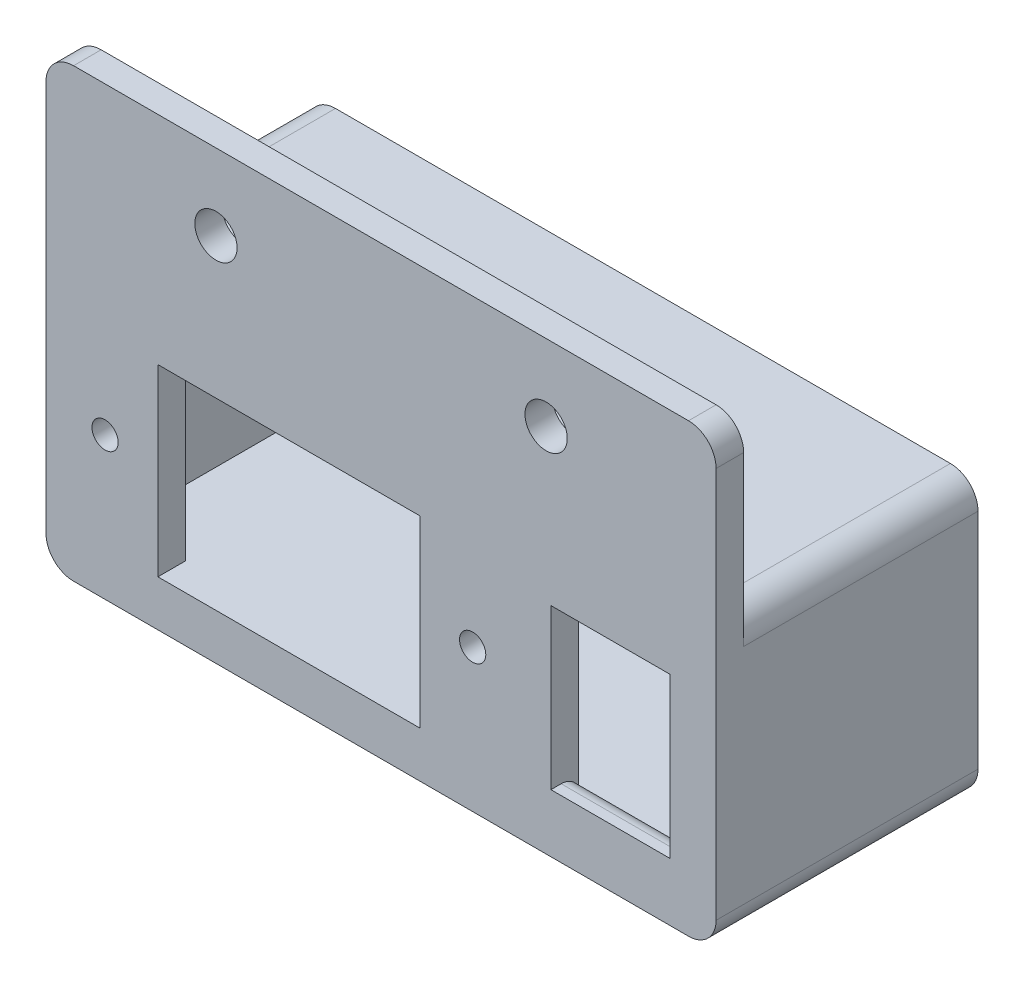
ISO-10303-21;
HEADER;
FILE_DESCRIPTION(('STEP AP214'),'2;1');
FILE_NAME('part.step','',(''),(''),'','','');
FILE_SCHEMA(('AUTOMOTIVE_DESIGN { 1 0 10303 214 1 1 1 1 }'));
ENDSEC;
DATA;
#1=APPLICATION_CONTEXT('core data for automotive mechanical design processes');
#2=APPLICATION_PROTOCOL_DEFINITION('international standard','automotive_design',2000,#1);
#3=PRODUCT_CONTEXT('',#1,'mechanical');
#4=PRODUCT('Part','Part','',(#3));
#5=PRODUCT_RELATED_PRODUCT_CATEGORY('part','',(#4));
#6=PRODUCT_DEFINITION_FORMATION('','',#4);
#7=PRODUCT_DEFINITION_CONTEXT('part definition',#1,'design');
#8=PRODUCT_DEFINITION('design','',#6,#7);
#9=PRODUCT_DEFINITION_SHAPE('','',#8);
#10=(LENGTH_UNIT() NAMED_UNIT(*) SI_UNIT(.MILLI.,.METRE.));
#11=(NAMED_UNIT(*) PLANE_ANGLE_UNIT() SI_UNIT($,.RADIAN.));
#12=(NAMED_UNIT(*) SI_UNIT($,.STERADIAN.) SOLID_ANGLE_UNIT());
#13=UNCERTAINTY_MEASURE_WITH_UNIT(LENGTH_MEASURE(1.E-05),#10,'distance_accuracy_value','');
#14=(GEOMETRIC_REPRESENTATION_CONTEXT(3) GLOBAL_UNCERTAINTY_ASSIGNED_CONTEXT((#13)) GLOBAL_UNIT_ASSIGNED_CONTEXT((#10,
#11,#12)) REPRESENTATION_CONTEXT('',''));
#15=CARTESIAN_POINT('',(0.,0.,0.));
#16=DIRECTION('',(0.,0.,1.));
#17=DIRECTION('',(1.,0.,0.));
#18=AXIS2_PLACEMENT_3D('',#15,#16,#17);
#19=CARTESIAN_POINT('',(33.985001,10.3,-21.));
#20=DIRECTION('',(0.,-1.,0.));
#21=DIRECTION('',(0.,0.,-1.));
#22=AXIS2_PLACEMENT_3D('',#19,#20,#21);
#23=PLANE('',#22);
#24=DIRECTION('',(0.,0.,1.));
#25=VECTOR('',#24,1.);
#26=CARTESIAN_POINT('',(31.985001,10.3,-21.));
#27=LINE('',#26,#25);
#28=CARTESIAN_POINT('',(31.985001,10.3,-24.));
#29=VERTEX_POINT('',#28);
#30=CARTESIAN_POINT('',(31.985001,10.3,0.));
#31=VERTEX_POINT('',#30);
#32=EDGE_CURVE('E286',#29,#31,#27,.T.);
#33=ORIENTED_EDGE('',*,*,#32,.T.);
#34=DIRECTION('',(1.,0.,0.));
#35=VECTOR('',#34,1.);
#36=CARTESIAN_POINT('',(33.985001,10.3,0.));
#37=LINE('',#36,#35);
#38=CARTESIAN_POINT('',(19.014999,10.3,0.));
#39=VERTEX_POINT('',#38);
#40=EDGE_CURVE('E291',#39,#31,#37,.T.);
#41=ORIENTED_EDGE('',*,*,#40,.F.);
#42=CARTESIAN_POINT('',(-30.9265875,10.3,0.));
#43=VERTEX_POINT('',#42);
#44=EDGE_CURVE('E292',#43,#39,#37,.T.);
#45=ORIENTED_EDGE('',*,*,#44,.F.);
#46=DIRECTION('',(0.,0.,1.));
#47=VECTOR('',#46,1.);
#48=CARTESIAN_POINT('',(-30.9265875,10.3,-21.));
#49=LINE('',#48,#47);
#50=CARTESIAN_POINT('',(-30.9265875,10.3,-24.));
#51=VERTEX_POINT('',#50);
#52=EDGE_CURVE('E283',#51,#43,#49,.T.);
#53=ORIENTED_EDGE('',*,*,#52,.F.);
#54=DIRECTION('',(1.,0.,0.));
#55=VECTOR('',#54,1.);
#56=CARTESIAN_POINT('',(-30.9265875,10.3,-24.));
#57=LINE('',#56,#55);
#58=EDGE_CURVE('E255',#51,#29,#57,.T.);
#59=ORIENTED_EDGE('',*,*,#58,.T.);
#60=EDGE_LOOP('',(#33,#41,#45,#53,#59));
#61=FACE_BOUND('',#60,.T.);
#62=ADVANCED_FACE('F35',(#61),#23,.T.);
#63=CARTESIAN_POINT('',(0.529206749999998,-58.9988552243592,0.));
#64=DIRECTION('',(0.,0.,1.));
#65=DIRECTION('',(1.,0.,0.));
#66=AXIS2_PLACEMENT_3D('',#63,#64,#65);
#67=PLANE('',#66);
#68=CARTESIAN_POINT('',(-17.434087,25.3,0.));
#69=DIRECTION('',(0.,0.,-1.));
#70=DIRECTION('',(1.,0.,0.));
#71=AXIS2_PLACEMENT_3D('',#68,#69,#70);
#72=CIRCLE('',#71,2.3);
#73=CARTESIAN_POINT('',(-15.134087,25.3,0.));
#74=VERTEX_POINT('',#73);
#75=EDGE_CURVE('E811',#74,#74,#72,.T.);
#76=ORIENTED_EDGE('',*,*,#75,.F.);
#77=EDGE_LOOP('',(#76));
#78=FACE_BOUND('',#77,.T.);
#79=CARTESIAN_POINT('',(18.4925005,25.3,0.));
#80=DIRECTION('',(0.,0.,-1.));
#81=DIRECTION('',(-1.,0.,0.));
#82=AXIS2_PLACEMENT_3D('',#79,#80,#81);
#83=CIRCLE('',#82,2.3);
#84=CARTESIAN_POINT('',(16.1925005,25.3,0.));
#85=VERTEX_POINT('',#84);
#86=EDGE_CURVE('E235',#85,#85,#83,.T.);
#87=ORIENTED_EDGE('',*,*,#86,.F.);
#88=EDGE_LOOP('',(#87));
#89=FACE_BOUND('',#88,.T.);
#90=DIRECTION('',(1.,0.,0.));
#91=VECTOR('',#90,1.);
#92=CARTESIAN_POINT('',(0.529206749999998,33.5776,0.));
#93=LINE('',#92,#91);
#94=CARTESIAN_POINT('',(-32.9265875,33.5776,0.));
#95=VERTEX_POINT('',#94);
#96=CARTESIAN_POINT('',(33.985001,33.5776,0.));
#97=VERTEX_POINT('',#96);
#98=EDGE_CURVE('E345',#95,#97,#93,.T.);
#99=ORIENTED_EDGE('',*,*,#98,.T.);
#100=CARTESIAN_POINT('',(33.985001,30.5776,0.));
#101=DIRECTION('',(0.,0.,1.));
#102=DIRECTION('',(1.,0.,0.));
#103=AXIS2_PLACEMENT_3D('',#100,#101,#102);
#104=CIRCLE('',#103,3.);
#105=CARTESIAN_POINT('',(36.985001,30.5776,0.));
#106=VERTEX_POINT('',#105);
#107=EDGE_CURVE('E375',#97,#106,#104,.F.);
#108=ORIENTED_EDGE('',*,*,#107,.T.);
#109=DIRECTION('',(0.,-1.,0.));
#110=VECTOR('',#109,1.);
#111=CARTESIAN_POINT('',(36.985001,-58.9988552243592,0.));
#112=LINE('',#111,#110);
#113=CARTESIAN_POINT('',(36.985001,12.3,0.));
#114=VERTEX_POINT('',#113);
#115=EDGE_CURVE('E342',#106,#114,#112,.T.);
#116=ORIENTED_EDGE('',*,*,#115,.T.);
#117=CARTESIAN_POINT('',(33.985001,12.3,0.));
#118=DIRECTION('',(0.,0.,1.));
#119=DIRECTION('',(1.,0.,0.));
#120=AXIS2_PLACEMENT_3D('',#117,#118,#119);
#121=CIRCLE('',#120,3.);
#122=CARTESIAN_POINT('',(33.985001,15.3,0.));
#123=VERTEX_POINT('',#122);
#124=EDGE_CURVE('E380',#114,#123,#121,.T.);
#125=ORIENTED_EDGE('',*,*,#124,.T.);
#126=DIRECTION('',(-1.,0.,0.));
#127=VECTOR('',#126,1.);
#128=CARTESIAN_POINT('',(-67.7584484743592,15.3,0.));
#129=LINE('',#128,#127);
#130=CARTESIAN_POINT('',(-32.9265875,15.3,0.));
#131=VERTEX_POINT('',#130);
#132=EDGE_CURVE('E268',#123,#131,#129,.T.);
#133=ORIENTED_EDGE('',*,*,#132,.T.);
#134=CARTESIAN_POINT('',(-32.9265875,12.3,0.));
#135=DIRECTION('',(0.,0.,1.));
#136=DIRECTION('',(1.,0.,0.));
#137=AXIS2_PLACEMENT_3D('',#134,#135,#136);
#138=CIRCLE('',#137,3.);
#139=CARTESIAN_POINT('',(-35.9265875,12.3,0.));
#140=VERTEX_POINT('',#139);
#141=EDGE_CURVE('E377',#131,#140,#138,.T.);
#142=ORIENTED_EDGE('',*,*,#141,.T.);
#143=DIRECTION('',(0.,1.,0.));
#144=VECTOR('',#143,1.);
#145=CARTESIAN_POINT('',(-35.9265875,-58.9988552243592,0.));
#146=LINE('',#145,#144);
#147=CARTESIAN_POINT('',(-35.9265875,30.5776,0.));
#148=VERTEX_POINT('',#147);
#149=EDGE_CURVE('E442',#140,#148,#146,.T.);
#150=ORIENTED_EDGE('',*,*,#149,.T.);
#151=CARTESIAN_POINT('',(-32.9265875,30.5776,0.));
#152=DIRECTION('',(0.,0.,1.));
#153=DIRECTION('',(1.,0.,0.));
#154=AXIS2_PLACEMENT_3D('',#151,#152,#153);
#155=CIRCLE('',#154,3.);
#156=EDGE_CURVE('E373',#148,#95,#155,.F.);
#157=ORIENTED_EDGE('',*,*,#156,.T.);
#158=EDGE_LOOP('',(#99,#108,#116,#125,#133,#142,#150,#157));
#159=FACE_BOUND('',#158,.T.);
#160=ADVANCED_FACE('F489',(#78,#89,#159),#67,.F.);
#161=CARTESIAN_POINT('',(0.529206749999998,8.67556,3.));
#162=DIRECTION('',(0.,1.,0.));
#163=DIRECTION('',(0.,0.,1.));
#164=AXIS2_PLACEMENT_3D('',#161,#162,#163);
#165=PLANE('',#164);
#166=DIRECTION('',(0.,0.,-1.));
#167=VECTOR('',#166,1.);
#168=CARTESIAN_POINT('',(19.014999,8.67556,3.));
#169=LINE('',#168,#167);
#170=CARTESIAN_POINT('',(19.014999,8.67556,3.));
#171=VERTEX_POINT('',#170);
#172=CARTESIAN_POINT('',(19.014999,8.67556,1.96442222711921));
#173=VERTEX_POINT('',#172);
#174=EDGE_CURVE('E395',#171,#173,#169,.T.);
#175=ORIENTED_EDGE('',*,*,#174,.T.);
#176=DIRECTION('',(1.,0.,0.));
#177=VECTOR('',#176,1.);
#178=CARTESIAN_POINT('',(0.529206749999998,8.67556,1.96442222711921));
#179=LINE('',#178,#177);
#180=CARTESIAN_POINT('',(31.985001,8.67556,1.96442222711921));
#181=VERTEX_POINT('',#180);
#182=EDGE_CURVE('E382',#173,#181,#179,.T.);
#183=ORIENTED_EDGE('',*,*,#182,.T.);
#184=DIRECTION('',(0.,0.,-1.));
#185=VECTOR('',#184,1.);
#186=CARTESIAN_POINT('',(31.985001,8.67556,3.));
#187=LINE('',#186,#185);
#188=CARTESIAN_POINT('',(31.985001,8.67556,3.));
#189=VERTEX_POINT('',#188);
#190=EDGE_CURVE('E412',#189,#181,#187,.T.);
#191=ORIENTED_EDGE('',*,*,#190,.F.);
#192=DIRECTION('',(1.,0.,0.));
#193=VECTOR('',#192,1.);
#194=CARTESIAN_POINT('',(0.529206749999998,8.67556,3.));
#195=LINE('',#194,#193);
#196=EDGE_CURVE('E325',#171,#189,#195,.T.);
#197=ORIENTED_EDGE('',*,*,#196,.F.);
#198=EDGE_LOOP('',(#175,#183,#191,#197));
#199=FACE_BOUND('',#198,.T.);
#200=ADVANCED_FACE('F402',(#199),#165,.F.);
#201=CARTESIAN_POINT('',(31.985001,-58.9988552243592,3.));
#202=DIRECTION('',(1.,0.,0.));
#203=DIRECTION('',(0.,1.,0.));
#204=AXIS2_PLACEMENT_3D('',#201,#202,#203);
#205=PLANE('',#204);
#206=ORIENTED_EDGE('',*,*,#190,.T.);
#207=CARTESIAN_POINT('',(31.985001,10.67556,1.96442222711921));
#208=DIRECTION('',(1.,0.,0.));
#209=DIRECTION('',(0.,1.,0.));
#210=AXIS2_PLACEMENT_3D('',#207,#208,#209);
#211=CIRCLE('',#210,2.);
#212=EDGE_CURVE('E387',#181,#31,#211,.T.);
#213=ORIENTED_EDGE('',*,*,#212,.T.);
#214=ORIENTED_EDGE('',*,*,#32,.F.);
#215=DIRECTION('',(0.,-1.,0.));
#216=VECTOR('',#215,1.);
#217=CARTESIAN_POINT('',(31.985001,10.3,-24.));
#218=LINE('',#217,#216);
#219=CARTESIAN_POINT('',(31.985001,-10.,-24.));
#220=VERTEX_POINT('',#219);
#221=EDGE_CURVE('E258',#29,#220,#218,.T.);
#222=ORIENTED_EDGE('',*,*,#221,.T.);
#223=DIRECTION('',(0.,0.,1.));
#224=VECTOR('',#223,1.);
#225=CARTESIAN_POINT('',(31.985001,-10.,-21.));
#226=LINE('',#225,#224);
#227=CARTESIAN_POINT('',(31.985001,-9.99999999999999,0.));
#228=VERTEX_POINT('',#227);
#229=EDGE_CURVE('E289',#220,#228,#226,.T.);
#230=ORIENTED_EDGE('',*,*,#229,.T.);
#231=CARTESIAN_POINT('',(31.985001,-10.67556,1.88245018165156));
#232=DIRECTION('',(1.,0.,0.));
#233=DIRECTION('',(0.,1.,0.));
#234=AXIS2_PLACEMENT_3D('',#231,#232,#233);
#235=CIRCLE('',#234,2.);
#236=CARTESIAN_POINT('',(31.985001,-8.67556,1.88245018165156));
#237=VERTEX_POINT('',#236);
#238=EDGE_CURVE('E43',#228,#237,#235,.T.);
#239=ORIENTED_EDGE('',*,*,#238,.T.);
#240=DIRECTION('',(0.,0.,-1.));
#241=VECTOR('',#240,1.);
#242=CARTESIAN_POINT('',(31.985001,-8.67556,3.));
#243=LINE('',#242,#241);
#244=CARTESIAN_POINT('',(31.985001,-8.67556,3.));
#245=VERTEX_POINT('',#244);
#246=EDGE_CURVE('E428',#245,#237,#243,.T.);
#247=ORIENTED_EDGE('',*,*,#246,.F.);
#248=DIRECTION('',(0.,-1.,0.));
#249=VECTOR('',#248,1.);
#250=CARTESIAN_POINT('',(31.985001,-58.9988552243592,3.));
#251=LINE('',#250,#249);
#252=EDGE_CURVE('E328',#189,#245,#251,.T.);
#253=ORIENTED_EDGE('',*,*,#252,.F.);
#254=EDGE_LOOP('',(#206,#213,#214,#222,#230,#239,#247,#253));
#255=FACE_BOUND('',#254,.T.);
#256=ADVANCED_FACE('F411',(#255),#205,.F.);
#257=CARTESIAN_POINT('',(0.529206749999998,-8.67556,3.));
#258=DIRECTION('',(0.,1.,0.));
#259=DIRECTION('',(0.,0.,1.));
#260=AXIS2_PLACEMENT_3D('',#257,#258,#259);
#261=PLANE('',#260);
#262=ORIENTED_EDGE('',*,*,#246,.T.);
#263=DIRECTION('',(1.,0.,0.));
#264=VECTOR('',#263,1.);
#265=CARTESIAN_POINT('',(19.014999,-8.67556,1.88245018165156));
#266=LINE('',#265,#264);
#267=CARTESIAN_POINT('',(19.014999,-8.67556,1.88245018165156));
#268=VERTEX_POINT('',#267);
#269=EDGE_CURVE('E56',#237,#268,#266,.F.);
#270=ORIENTED_EDGE('',*,*,#269,.T.);
#271=DIRECTION('',(0.,0.,-1.));
#272=VECTOR('',#271,1.);
#273=CARTESIAN_POINT('',(19.014999,-8.67556,3.));
#274=LINE('',#273,#272);
#275=CARTESIAN_POINT('',(19.014999,-8.67556,3.));
#276=VERTEX_POINT('',#275);
#277=EDGE_CURVE('E406',#276,#268,#274,.T.);
#278=ORIENTED_EDGE('',*,*,#277,.F.);
#279=DIRECTION('',(1.,0.,0.));
#280=VECTOR('',#279,1.);
#281=CARTESIAN_POINT('',(0.529206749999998,-8.67556,3.));
#282=LINE('',#281,#280);
#283=EDGE_CURVE('E330',#276,#245,#282,.T.);
#284=ORIENTED_EDGE('',*,*,#283,.T.);
#285=EDGE_LOOP('',(#262,#270,#278,#284));
#286=FACE_BOUND('',#285,.T.);
#287=ADVANCED_FACE('F479',(#286),#261,.T.);
#288=CARTESIAN_POINT('',(0.529206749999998,9.99999999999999,3.));
#289=DIRECTION('',(0.,1.,0.));
#290=DIRECTION('',(0.,0.,1.));
#291=AXIS2_PLACEMENT_3D('',#288,#289,#290);
#292=PLANE('',#291);
#293=DIRECTION('',(1.,0.,0.));
#294=VECTOR('',#293,1.);
#295=CARTESIAN_POINT('',(0.529206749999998,9.99999999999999,0.));
#296=LINE('',#295,#294);
#297=CARTESIAN_POINT('',(-23.75,9.99999999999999,0.));
#298=VERTEX_POINT('',#297);
#299=CARTESIAN_POINT('',(4.75,9.99999999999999,0.));
#300=VERTEX_POINT('',#299);
#301=EDGE_CURVE('E445',#298,#300,#296,.T.);
#302=ORIENTED_EDGE('',*,*,#301,.T.);
#303=DIRECTION('',(0.,0.,-1.));
#304=VECTOR('',#303,1.);
#305=CARTESIAN_POINT('',(4.75,9.99999999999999,3.));
#306=LINE('',#305,#304);
#307=CARTESIAN_POINT('',(4.75,9.99999999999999,3.));
#308=VERTEX_POINT('',#307);
#309=EDGE_CURVE('E407',#308,#300,#306,.T.);
#310=ORIENTED_EDGE('',*,*,#309,.F.);
#311=DIRECTION('',(1.,0.,0.));
#312=VECTOR('',#311,1.);
#313=CARTESIAN_POINT('',(0.529206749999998,9.99999999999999,3.));
#314=LINE('',#313,#312);
#315=CARTESIAN_POINT('',(-23.75,9.99999999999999,3.));
#316=VERTEX_POINT('',#315);
#317=EDGE_CURVE('E314',#316,#308,#314,.T.);
#318=ORIENTED_EDGE('',*,*,#317,.F.);
#319=DIRECTION('',(0.,0.,-1.));
#320=VECTOR('',#319,1.);
#321=CARTESIAN_POINT('',(-23.75,9.99999999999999,3.));
#322=LINE('',#321,#320);
#323=EDGE_CURVE('E336',#316,#298,#322,.T.);
#324=ORIENTED_EDGE('',*,*,#323,.T.);
#325=EDGE_LOOP('',(#302,#310,#318,#324));
#326=FACE_BOUND('',#325,.T.);
#327=ADVANCED_FACE('F477',(#326),#292,.F.);
#328=CARTESIAN_POINT('',(4.75000000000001,-58.9988552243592,3.));
#329=DIRECTION('',(1.,0.,0.));
#330=DIRECTION('',(0.,1.,0.));
#331=AXIS2_PLACEMENT_3D('',#328,#329,#330);
#332=PLANE('',#331);
#333=DIRECTION('',(0.,-1.,0.));
#334=VECTOR('',#333,1.);
#335=CARTESIAN_POINT('',(4.75000000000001,-58.9988552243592,0.));
#336=LINE('',#335,#334);
#337=CARTESIAN_POINT('',(4.75,-10.,0.));
#338=VERTEX_POINT('',#337);
#339=EDGE_CURVE('E451',#300,#338,#336,.T.);
#340=ORIENTED_EDGE('',*,*,#339,.T.);
#341=DIRECTION('',(0.,0.,-1.));
#342=VECTOR('',#341,1.);
#343=CARTESIAN_POINT('',(4.75,-10.,3.));
#344=LINE('',#343,#342);
#345=CARTESIAN_POINT('',(4.75,-10.,3.));
#346=VERTEX_POINT('',#345);
#347=EDGE_CURVE('E438',#346,#338,#344,.T.);
#348=ORIENTED_EDGE('',*,*,#347,.F.);
#349=DIRECTION('',(0.,-1.,0.));
#350=VECTOR('',#349,1.);
#351=CARTESIAN_POINT('',(4.75000000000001,-58.9988552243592,3.));
#352=LINE('',#351,#350);
#353=EDGE_CURVE('E317',#308,#346,#352,.T.);
#354=ORIENTED_EDGE('',*,*,#353,.F.);
#355=ORIENTED_EDGE('',*,*,#309,.T.);
#356=EDGE_LOOP('',(#340,#348,#354,#355));
#357=FACE_BOUND('',#356,.T.);
#358=ADVANCED_FACE('F475',(#357),#332,.F.);
#359=CARTESIAN_POINT('',(0.529206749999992,-10.,3.));
#360=DIRECTION('',(0.,1.,0.));
#361=DIRECTION('',(-1.,0.,0.));
#362=AXIS2_PLACEMENT_3D('',#359,#360,#361);
#363=PLANE('',#362);
#364=ORIENTED_EDGE('',*,*,#347,.T.);
#365=DIRECTION('',(-1.,0.,0.));
#366=VECTOR('',#365,1.);
#367=CARTESIAN_POINT('',(-67.7584484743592,-10.,0.));
#368=LINE('',#367,#366);
#369=CARTESIAN_POINT('',(19.014999,-10.,0.));
#370=VERTEX_POINT('',#369);
#371=EDGE_CURVE('E276',#370,#338,#368,.T.);
#372=ORIENTED_EDGE('',*,*,#371,.F.);
#373=EDGE_CURVE('E272',#228,#370,#368,.T.);
#374=ORIENTED_EDGE('',*,*,#373,.F.);
#375=ORIENTED_EDGE('',*,*,#229,.F.);
#376=DIRECTION('',(-1.,0.,0.));
#377=VECTOR('',#376,1.);
#378=CARTESIAN_POINT('',(31.985001,-10.,-24.));
#379=LINE('',#378,#377);
#380=CARTESIAN_POINT('',(-30.9265875,-10.,-24.));
#381=VERTEX_POINT('',#380);
#382=EDGE_CURVE('E261',#220,#381,#379,.T.);
#383=ORIENTED_EDGE('',*,*,#382,.T.);
#384=DIRECTION('',(0.,0.,1.));
#385=VECTOR('',#384,1.);
#386=CARTESIAN_POINT('',(-30.9265875,-10.,-21.));
#387=LINE('',#386,#385);
#388=CARTESIAN_POINT('',(-30.9265875,-9.99999999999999,0.));
#389=VERTEX_POINT('',#388);
#390=EDGE_CURVE('E280',#381,#389,#387,.T.);
#391=ORIENTED_EDGE('',*,*,#390,.T.);
#392=CARTESIAN_POINT('',(-23.75,-10.,0.));
#393=VERTEX_POINT('',#392);
#394=EDGE_CURVE('E271',#393,#389,#368,.T.);
#395=ORIENTED_EDGE('',*,*,#394,.F.);
#396=DIRECTION('',(0.,0.,-1.));
#397=VECTOR('',#396,1.);
#398=CARTESIAN_POINT('',(-23.75,-10.,3.));
#399=LINE('',#398,#397);
#400=CARTESIAN_POINT('',(-23.75,-10.,3.));
#401=VERTEX_POINT('',#400);
#402=EDGE_CURVE('E436',#401,#393,#399,.T.);
#403=ORIENTED_EDGE('',*,*,#402,.F.);
#404=DIRECTION('',(1.,0.,0.));
#405=VECTOR('',#404,1.);
#406=CARTESIAN_POINT('',(0.529206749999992,-10.,3.));
#407=LINE('',#406,#405);
#408=EDGE_CURVE('E319',#401,#346,#407,.T.);
#409=ORIENTED_EDGE('',*,*,#408,.T.);
#410=EDGE_LOOP('',(#364,#372,#374,#375,#383,#391,#395,#403,#409));
#411=FACE_BOUND('',#410,.T.);
#412=ADVANCED_FACE('F424',(#411),#363,.T.);
#413=CARTESIAN_POINT('',(36.985001,-58.9988552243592,3.));
#414=DIRECTION('',(1.,0.,0.));
#415=DIRECTION('',(0.,0.,-1.));
#416=AXIS2_PLACEMENT_3D('',#413,#414,#415);
#417=PLANE('',#416);
#418=DIRECTION('',(0.,0.,-1.));
#419=VECTOR('',#418,1.);
#420=CARTESIAN_POINT('',(36.985001,-12.,3.));
#421=LINE('',#420,#419);
#422=CARTESIAN_POINT('',(36.985001,-12.,3.));
#423=VERTEX_POINT('',#422);
#424=CARTESIAN_POINT('',(36.985001,-12.,-25.5));
#425=VERTEX_POINT('',#424);
#426=EDGE_CURVE('E352',#423,#425,#421,.T.);
#427=ORIENTED_EDGE('',*,*,#426,.T.);
#428=DIRECTION('',(0.,-1.,0.));
#429=VECTOR('',#428,1.);
#430=CARTESIAN_POINT('',(36.985001,12.3,-25.5));
#431=LINE('',#430,#429);
#432=CARTESIAN_POINT('',(36.985001,12.3,-25.5));
#433=VERTEX_POINT('',#432);
#434=EDGE_CURVE('E246',#433,#425,#431,.T.);
#435=ORIENTED_EDGE('',*,*,#434,.F.);
#436=DIRECTION('',(0.,0.,1.));
#437=VECTOR('',#436,1.);
#438=CARTESIAN_POINT('',(36.985001,12.3,3.));
#439=LINE('',#438,#437);
#440=EDGE_CURVE('E354',#433,#114,#439,.T.);
#441=ORIENTED_EDGE('',*,*,#440,.T.);
#442=ORIENTED_EDGE('',*,*,#115,.F.);
#443=DIRECTION('',(0.,0.,-1.));
#444=VECTOR('',#443,1.);
#445=CARTESIAN_POINT('',(36.985001,30.5776,3.));
#446=LINE('',#445,#444);
#447=CARTESIAN_POINT('',(36.985001,30.5776,3.));
#448=VERTEX_POINT('',#447);
#449=EDGE_CURVE('E350',#106,#448,#446,.F.);
#450=ORIENTED_EDGE('',*,*,#449,.T.);
#451=DIRECTION('',(0.,-1.,0.));
#452=VECTOR('',#451,1.);
#453=CARTESIAN_POINT('',(36.985001,-58.9988552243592,3.));
#454=LINE('',#453,#452);
#455=EDGE_CURVE('E303',#448,#423,#454,.T.);
#456=ORIENTED_EDGE('',*,*,#455,.T.);
#457=EDGE_LOOP('',(#427,#435,#441,#442,#450,#456));
#458=FACE_BOUND('',#457,.T.);
#459=ADVANCED_FACE('F516',(#458),#417,.T.);
#460=CARTESIAN_POINT('',(0.529206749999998,33.5776,3.));
#461=DIRECTION('',(0.,1.,0.));
#462=DIRECTION('',(0.,0.,1.));
#463=AXIS2_PLACEMENT_3D('',#460,#461,#462);
#464=PLANE('',#463);
#465=DIRECTION('',(1.,0.,0.));
#466=VECTOR('',#465,1.);
#467=CARTESIAN_POINT('',(0.529206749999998,33.5776,3.));
#468=LINE('',#467,#466);
#469=CARTESIAN_POINT('',(-32.9265875,33.5776,3.));
#470=VERTEX_POINT('',#469);
#471=CARTESIAN_POINT('',(33.985001,33.5776,3.));
#472=VERTEX_POINT('',#471);
#473=EDGE_CURVE('E306',#470,#472,#468,.T.);
#474=ORIENTED_EDGE('',*,*,#473,.T.);
#475=DIRECTION('',(0.,0.,-1.));
#476=VECTOR('',#475,1.);
#477=CARTESIAN_POINT('',(33.985001,33.5776,3.));
#478=LINE('',#477,#476);
#479=EDGE_CURVE('E370',#472,#97,#478,.T.);
#480=ORIENTED_EDGE('',*,*,#479,.T.);
#481=ORIENTED_EDGE('',*,*,#98,.F.);
#482=DIRECTION('',(0.,0.,-1.));
#483=VECTOR('',#482,1.);
#484=CARTESIAN_POINT('',(-32.9265875,33.5776,3.));
#485=LINE('',#484,#483);
#486=EDGE_CURVE('E368',#95,#470,#485,.F.);
#487=ORIENTED_EDGE('',*,*,#486,.T.);
#488=EDGE_LOOP('',(#474,#480,#481,#487));
#489=FACE_BOUND('',#488,.T.);
#490=ADVANCED_FACE('F520',(#489),#464,.T.);
#491=CARTESIAN_POINT('',(-35.9265875,-58.9988552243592,3.));
#492=DIRECTION('',(-1.,0.,0.));
#493=DIRECTION('',(0.,0.,1.));
#494=AXIS2_PLACEMENT_3D('',#491,#492,#493);
#495=PLANE('',#494);
#496=CARTESIAN_POINT('',(-35.9265875,0.535225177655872,-15.80625));
#497=DIRECTION('',(-1.,0.,0.));
#498=DIRECTION('',(0.,0.,1.));
#499=AXIS2_PLACEMENT_3D('',#496,#497,#498);
#500=CIRCLE('',#499,4.5);
#501=CARTESIAN_POINT('',(-35.9265875,0.535225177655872,-11.30625));
#502=VERTEX_POINT('',#501);
#503=EDGE_CURVE('E264',#502,#502,#500,.T.);
#504=ORIENTED_EDGE('',*,*,#503,.F.);
#505=EDGE_LOOP('',(#504));
#506=FACE_BOUND('',#505,.T.);
#507=ORIENTED_EDGE('',*,*,#149,.F.);
#508=DIRECTION('',(0.,0.,1.));
#509=VECTOR('',#508,1.);
#510=CARTESIAN_POINT('',(-35.9265875,12.3,3.));
#511=LINE('',#510,#509);
#512=CARTESIAN_POINT('',(-35.9265875,12.3,-25.5));
#513=VERTEX_POINT('',#512);
#514=EDGE_CURVE('E215',#140,#513,#511,.F.);
#515=ORIENTED_EDGE('',*,*,#514,.T.);
#516=DIRECTION('',(0.,1.,0.));
#517=VECTOR('',#516,1.);
#518=CARTESIAN_POINT('',(-35.9265875,-12.,-25.5));
#519=LINE('',#518,#517);
#520=CARTESIAN_POINT('',(-35.9265875,-12.,-25.5));
#521=VERTEX_POINT('',#520);
#522=EDGE_CURVE('E219',#521,#513,#519,.T.);
#523=ORIENTED_EDGE('',*,*,#522,.F.);
#524=DIRECTION('',(0.,0.,-1.));
#525=VECTOR('',#524,1.);
#526=CARTESIAN_POINT('',(-35.9265875,-12.,3.));
#527=LINE('',#526,#525);
#528=CARTESIAN_POINT('',(-35.9265875,-12.,3.));
#529=VERTEX_POINT('',#528);
#530=EDGE_CURVE('E205',#521,#529,#527,.F.);
#531=ORIENTED_EDGE('',*,*,#530,.T.);
#532=DIRECTION('',(0.,1.,0.));
#533=VECTOR('',#532,1.);
#534=CARTESIAN_POINT('',(-35.9265875,-58.9988552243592,3.));
#535=LINE('',#534,#533);
#536=CARTESIAN_POINT('',(-35.9265875,30.5776,3.));
#537=VERTEX_POINT('',#536);
#538=EDGE_CURVE('E309',#529,#537,#535,.T.);
#539=ORIENTED_EDGE('',*,*,#538,.T.);
#540=DIRECTION('',(0.,0.,-1.));
#541=VECTOR('',#540,1.);
#542=CARTESIAN_POINT('',(-35.9265875,30.5776,3.));
#543=LINE('',#542,#541);
#544=EDGE_CURVE('E216',#537,#148,#543,.T.);
#545=ORIENTED_EDGE('',*,*,#544,.T.);
#546=EDGE_LOOP('',(#507,#515,#523,#531,#539,#545));
#547=FACE_BOUND('',#546,.T.);
#548=ADVANCED_FACE('F220',(#506,#547),#495,.T.);
#549=CARTESIAN_POINT('',(-23.75,-58.9988552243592,3.));
#550=DIRECTION('',(1.,0.,0.));
#551=DIRECTION('',(0.,0.,-1.));
#552=AXIS2_PLACEMENT_3D('',#549,#550,#551);
#553=PLANE('',#552);
#554=DIRECTION('',(0.,-1.,0.));
#555=VECTOR('',#554,1.);
#556=CARTESIAN_POINT('',(-23.75,-58.9988552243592,0.));
#557=LINE('',#556,#555);
#558=EDGE_CURVE('E454',#298,#393,#557,.T.);
#559=ORIENTED_EDGE('',*,*,#558,.F.);
#560=ORIENTED_EDGE('',*,*,#323,.F.);
#561=DIRECTION('',(0.,-1.,0.));
#562=VECTOR('',#561,1.);
#563=CARTESIAN_POINT('',(-23.75,-58.9988552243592,3.));
#564=LINE('',#563,#562);
#565=EDGE_CURVE('E322',#316,#401,#564,.T.);
#566=ORIENTED_EDGE('',*,*,#565,.T.);
#567=ORIENTED_EDGE('',*,*,#402,.T.);
#568=EDGE_LOOP('',(#559,#560,#566,#567));
#569=FACE_BOUND('',#568,.T.);
#570=ADVANCED_FACE('F466',(#569),#553,.T.);
#571=CARTESIAN_POINT('',(0.529206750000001,-15.,3.));
#572=DIRECTION('',(0.,-1.,0.));
#573=DIRECTION('',(1.,0.,0.));
#574=AXIS2_PLACEMENT_3D('',#571,#572,#573);
#575=PLANE('',#574);
#576=DIRECTION('',(-1.,0.,0.));
#577=VECTOR('',#576,1.);
#578=CARTESIAN_POINT('',(0.529206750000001,-15.,3.));
#579=LINE('',#578,#577);
#580=CARTESIAN_POINT('',(33.985001,-15.,3.));
#581=VERTEX_POINT('',#580);
#582=CARTESIAN_POINT('',(-32.9265875,-15.,3.));
#583=VERTEX_POINT('',#582);
#584=EDGE_CURVE('E311',#581,#583,#579,.T.);
#585=ORIENTED_EDGE('',*,*,#584,.T.);
#586=DIRECTION('',(0.,0.,-1.));
#587=VECTOR('',#586,1.);
#588=CARTESIAN_POINT('',(-32.9265875,-15.,3.));
#589=LINE('',#588,#587);
#590=CARTESIAN_POINT('',(-32.9265875,-15.,-25.5));
#591=VERTEX_POINT('',#590);
#592=EDGE_CURVE('E359',#583,#591,#589,.T.);
#593=ORIENTED_EDGE('',*,*,#592,.T.);
#594=DIRECTION('',(-1.,0.,0.));
#595=VECTOR('',#594,1.);
#596=CARTESIAN_POINT('',(33.985001,-15.,-25.5));
#597=LINE('',#596,#595);
#598=CARTESIAN_POINT('',(33.985001,-15.,-25.5));
#599=VERTEX_POINT('',#598);
#600=EDGE_CURVE('E231',#599,#591,#597,.T.);
#601=ORIENTED_EDGE('',*,*,#600,.F.);
#602=DIRECTION('',(0.,0.,-1.));
#603=VECTOR('',#602,1.);
#604=CARTESIAN_POINT('',(33.985001,-15.,3.));
#605=LINE('',#604,#603);
#606=EDGE_CURVE('E357',#599,#581,#605,.F.);
#607=ORIENTED_EDGE('',*,*,#606,.T.);
#608=EDGE_LOOP('',(#585,#593,#601,#607));
#609=FACE_BOUND('',#608,.T.);
#610=ADVANCED_FACE('F514',(#609),#575,.T.);
#611=CARTESIAN_POINT('',(10.5,0.4999975,3.));
#612=DIRECTION('',(0.,0.,-1.));
#613=DIRECTION('',(-1.,0.,0.));
#614=AXIS2_PLACEMENT_3D('',#611,#612,#613);
#615=CYLINDRICAL_SURFACE('',#614,1.4265825);
#616=CARTESIAN_POINT('',(10.5,0.4999975,3.));
#617=DIRECTION('',(0.,0.,1.));
#618=DIRECTION('',(1.,0.,0.));
#619=AXIS2_PLACEMENT_3D('',#616,#617,#618);
#620=CIRCLE('',#619,1.4265825);
#621=CARTESIAN_POINT('',(11.9265825,0.4999975,3.));
#622=VERTEX_POINT('',#621);
#623=EDGE_CURVE('E299',#622,#622,#620,.T.);
#624=ORIENTED_EDGE('',*,*,#623,.T.);
#625=EDGE_LOOP('',(#624));
#626=FACE_BOUND('',#625,.T.);
#627=CARTESIAN_POINT('',(10.5,0.4999975,0.));
#628=DIRECTION('',(0.,0.,1.));
#629=DIRECTION('',(1.,0.,0.));
#630=AXIS2_PLACEMENT_3D('',#627,#628,#629);
#631=CIRCLE('',#630,1.4265825);
#632=CARTESIAN_POINT('',(11.9265825,0.4999975,0.));
#633=VERTEX_POINT('',#632);
#634=EDGE_CURVE('E339',#633,#633,#631,.T.);
#635=ORIENTED_EDGE('',*,*,#634,.F.);
#636=EDGE_LOOP('',(#635));
#637=FACE_BOUND('',#636,.T.);
#638=ADVANCED_FACE('F530',(#626,#637),#615,.F.);
#639=CARTESIAN_POINT('',(-29.5,0.5000025,3.));
#640=DIRECTION('',(0.,0.,-1.));
#641=DIRECTION('',(-1.,0.,0.));
#642=AXIS2_PLACEMENT_3D('',#639,#640,#641);
#643=CYLINDRICAL_SURFACE('',#642,1.4265875);
#644=CARTESIAN_POINT('',(-29.5,0.5000025,3.));
#645=DIRECTION('',(0.,0.,1.));
#646=DIRECTION('',(1.,0.,0.));
#647=AXIS2_PLACEMENT_3D('',#644,#645,#646);
#648=CIRCLE('',#647,1.4265875);
#649=CARTESIAN_POINT('',(-28.0734125,0.5000025,3.));
#650=VERTEX_POINT('',#649);
#651=EDGE_CURVE('E296',#650,#650,#648,.T.);
#652=ORIENTED_EDGE('',*,*,#651,.T.);
#653=EDGE_LOOP('',(#652));
#654=FACE_BOUND('',#653,.T.);
#655=CARTESIAN_POINT('',(-29.5,0.5000025,0.));
#656=DIRECTION('',(0.,0.,1.));
#657=DIRECTION('',(1.,0.,0.));
#658=AXIS2_PLACEMENT_3D('',#655,#656,#657);
#659=CIRCLE('',#658,1.4265875);
#660=CARTESIAN_POINT('',(-30.9265875,0.500002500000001,0.));
#661=VERTEX_POINT('',#660);
#662=EDGE_CURVE('E295',#661,#661,#659,.T.);
#663=ORIENTED_EDGE('',*,*,#662,.F.);
#664=EDGE_LOOP('',(#663));
#665=FACE_BOUND('',#664,.T.);
#666=ADVANCED_FACE('F507',(#654,#665),#643,.F.);
#667=CARTESIAN_POINT('',(19.014999,-58.9988552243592,3.));
#668=DIRECTION('',(1.,0.,0.));
#669=DIRECTION('',(0.,1.,0.));
#670=AXIS2_PLACEMENT_3D('',#667,#668,#669);
#671=PLANE('',#670);
#672=DIRECTION('',(0.,-1.,0.));
#673=VECTOR('',#672,1.);
#674=CARTESIAN_POINT('',(19.014999,-58.9988552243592,0.));
#675=LINE('',#674,#673);
#676=EDGE_CURVE('E300',#39,#370,#675,.T.);
#677=ORIENTED_EDGE('',*,*,#676,.F.);
#678=CARTESIAN_POINT('',(19.014999,10.67556,1.96442222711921));
#679=DIRECTION('',(1.,0.,0.));
#680=DIRECTION('',(0.,1.,0.));
#681=AXIS2_PLACEMENT_3D('',#678,#679,#680);
#682=CIRCLE('',#681,2.);
#683=EDGE_CURVE('E389',#39,#173,#682,.F.);
#684=ORIENTED_EDGE('',*,*,#683,.T.);
#685=ORIENTED_EDGE('',*,*,#174,.F.);
#686=DIRECTION('',(0.,-1.,0.));
#687=VECTOR('',#686,1.);
#688=CARTESIAN_POINT('',(19.014999,-58.9988552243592,3.));
#689=LINE('',#688,#687);
#690=EDGE_CURVE('E333',#171,#276,#689,.T.);
#691=ORIENTED_EDGE('',*,*,#690,.T.);
#692=ORIENTED_EDGE('',*,*,#277,.T.);
#693=CARTESIAN_POINT('',(19.014999,-10.67556,1.88245018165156));
#694=DIRECTION('',(1.,0.,0.));
#695=DIRECTION('',(0.,1.,0.));
#696=AXIS2_PLACEMENT_3D('',#693,#694,#695);
#697=CIRCLE('',#696,2.);
#698=EDGE_CURVE('E11',#268,#370,#697,.F.);
#699=ORIENTED_EDGE('',*,*,#698,.T.);
#700=EDGE_LOOP('',(#677,#684,#685,#691,#692,#699));
#701=FACE_BOUND('',#700,.T.);
#702=ADVANCED_FACE('F394',(#701),#671,.T.);
#703=CARTESIAN_POINT('',(0.529206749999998,-58.9988552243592,3.));
#704=DIRECTION('',(0.,0.,1.));
#705=DIRECTION('',(1.,0.,0.));
#706=AXIS2_PLACEMENT_3D('',#703,#704,#705);
#707=PLANE('',#706);
#708=CARTESIAN_POINT('',(-17.434087,25.3,3.));
#709=DIRECTION('',(0.,0.,-1.));
#710=DIRECTION('',(1.,0.,0.));
#711=AXIS2_PLACEMENT_3D('',#708,#709,#710);
#712=CIRCLE('',#711,2.3);
#713=CARTESIAN_POINT('',(-15.134087,25.3,3.));
#714=VERTEX_POINT('',#713);
#715=EDGE_CURVE('E808',#714,#714,#712,.T.);
#716=ORIENTED_EDGE('',*,*,#715,.T.);
#717=EDGE_LOOP('',(#716));
#718=FACE_BOUND('',#717,.T.);
#719=CARTESIAN_POINT('',(18.4925005,25.3,3.));
#720=DIRECTION('',(0.,0.,-1.));
#721=DIRECTION('',(-1.,0.,0.));
#722=AXIS2_PLACEMENT_3D('',#719,#720,#721);
#723=CIRCLE('',#722,2.3);
#724=CARTESIAN_POINT('',(16.1925005,25.3,3.));
#725=VERTEX_POINT('',#724);
#726=EDGE_CURVE('E232',#725,#725,#723,.T.);
#727=ORIENTED_EDGE('',*,*,#726,.T.);
#728=EDGE_LOOP('',(#727));
#729=FACE_BOUND('',#728,.T.);
#730=ORIENTED_EDGE('',*,*,#651,.F.);
#731=EDGE_LOOP('',(#730));
#732=FACE_BOUND('',#731,.T.);
#733=ORIENTED_EDGE('',*,*,#623,.F.);
#734=EDGE_LOOP('',(#733));
#735=FACE_BOUND('',#734,.T.);
#736=ORIENTED_EDGE('',*,*,#538,.F.);
#737=CARTESIAN_POINT('',(-32.9265875,-12.,3.));
#738=DIRECTION('',(0.,0.,1.));
#739=DIRECTION('',(1.,0.,0.));
#740=AXIS2_PLACEMENT_3D('',#737,#738,#739);
#741=CIRCLE('',#740,3.);
#742=EDGE_CURVE('E211',#529,#583,#741,.T.);
#743=ORIENTED_EDGE('',*,*,#742,.T.);
#744=ORIENTED_EDGE('',*,*,#584,.F.);
#745=CARTESIAN_POINT('',(33.985001,-12.,3.));
#746=DIRECTION('',(0.,0.,1.));
#747=DIRECTION('',(1.,0.,0.));
#748=AXIS2_PLACEMENT_3D('',#745,#746,#747);
#749=CIRCLE('',#748,3.);
#750=EDGE_CURVE('E365',#581,#423,#749,.T.);
#751=ORIENTED_EDGE('',*,*,#750,.T.);
#752=ORIENTED_EDGE('',*,*,#455,.F.);
#753=CARTESIAN_POINT('',(33.985001,30.5776,3.));
#754=DIRECTION('',(0.,0.,1.));
#755=DIRECTION('',(1.,0.,0.));
#756=AXIS2_PLACEMENT_3D('',#753,#754,#755);
#757=CIRCLE('',#756,3.);
#758=EDGE_CURVE('E363',#448,#472,#757,.T.);
#759=ORIENTED_EDGE('',*,*,#758,.T.);
#760=ORIENTED_EDGE('',*,*,#473,.F.);
#761=CARTESIAN_POINT('',(-32.9265875,30.5776,3.));
#762=DIRECTION('',(0.,0.,1.));
#763=DIRECTION('',(1.,0.,0.));
#764=AXIS2_PLACEMENT_3D('',#761,#762,#763);
#765=CIRCLE('',#764,3.);
#766=EDGE_CURVE('E361',#470,#537,#765,.T.);
#767=ORIENTED_EDGE('',*,*,#766,.T.);
#768=EDGE_LOOP('',(#736,#743,#744,#751,#752,#759,#760,#767));
#769=FACE_BOUND('',#768,.T.);
#770=ORIENTED_EDGE('',*,*,#317,.T.);
#771=ORIENTED_EDGE('',*,*,#353,.T.);
#772=ORIENTED_EDGE('',*,*,#408,.F.);
#773=ORIENTED_EDGE('',*,*,#565,.F.);
#774=EDGE_LOOP('',(#770,#771,#772,#773));
#775=FACE_BOUND('',#774,.T.);
#776=ORIENTED_EDGE('',*,*,#196,.T.);
#777=ORIENTED_EDGE('',*,*,#252,.T.);
#778=ORIENTED_EDGE('',*,*,#283,.F.);
#779=ORIENTED_EDGE('',*,*,#690,.F.);
#780=EDGE_LOOP('',(#776,#777,#778,#779));
#781=FACE_BOUND('',#780,.T.);
#782=ADVANCED_FACE('F470',(#718,#729,#732,#735,#769,#775,#781),#707,.T.);
#783=ORIENTED_EDGE('',*,*,#634,.T.);
#784=EDGE_LOOP('',(#783));
#785=FACE_BOUND('',#784,.T.);
#786=ORIENTED_EDGE('',*,*,#676,.T.);
#787=ORIENTED_EDGE('',*,*,#371,.T.);
#788=ORIENTED_EDGE('',*,*,#339,.F.);
#789=ORIENTED_EDGE('',*,*,#301,.F.);
#790=ORIENTED_EDGE('',*,*,#558,.T.);
#791=ORIENTED_EDGE('',*,*,#394,.T.);
#792=DIRECTION('',(0.,-1.,0.));
#793=VECTOR('',#792,1.);
#794=CARTESIAN_POINT('',(-30.9265875,9.28879999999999,0.));
#795=LINE('',#794,#793);
#796=EDGE_CURVE('E275',#661,#389,#795,.T.);
#797=ORIENTED_EDGE('',*,*,#796,.F.);
#798=ORIENTED_EDGE('',*,*,#662,.T.);
#799=EDGE_CURVE('E277',#43,#661,#795,.T.);
#800=ORIENTED_EDGE('',*,*,#799,.F.);
#801=ORIENTED_EDGE('',*,*,#44,.T.);
#802=EDGE_LOOP('',(#786,#787,#788,#789,#790,#791,#797,#798,#800,#801));
#803=FACE_BOUND('',#802,.T.);
#804=ADVANCED_FACE('F457',(#785,#803),#67,.F.);
#805=CARTESIAN_POINT('',(-30.9265875,9.28879999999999,-21.));
#806=DIRECTION('',(-1.,0.,0.));
#807=DIRECTION('',(0.,-1.,0.));
#808=AXIS2_PLACEMENT_3D('',#805,#806,#807);
#809=PLANE('',#808);
#810=CARTESIAN_POINT('',(-30.9265875,0.535225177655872,-15.80625));
#811=DIRECTION('',(-1.,0.,0.));
#812=DIRECTION('',(0.,-1.,0.));
#813=AXIS2_PLACEMENT_3D('',#810,#811,#812);
#814=CIRCLE('',#813,4.5);
#815=CARTESIAN_POINT('',(-30.9265875,-3.96477482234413,-15.80625));
#816=VERTEX_POINT('',#815);
#817=EDGE_CURVE('E267',#816,#816,#814,.T.);
#818=ORIENTED_EDGE('',*,*,#817,.T.);
#819=EDGE_LOOP('',(#818));
#820=FACE_BOUND('',#819,.T.);
#821=ORIENTED_EDGE('',*,*,#799,.T.);
#822=ORIENTED_EDGE('',*,*,#796,.T.);
#823=ORIENTED_EDGE('',*,*,#390,.F.);
#824=DIRECTION('',(0.,1.,0.));
#825=VECTOR('',#824,1.);
#826=CARTESIAN_POINT('',(-30.9265875,10.3,-24.));
#827=LINE('',#826,#825);
#828=EDGE_CURVE('E252',#381,#51,#827,.T.);
#829=ORIENTED_EDGE('',*,*,#828,.T.);
#830=ORIENTED_EDGE('',*,*,#52,.T.);
#831=EDGE_LOOP('',(#821,#822,#823,#829,#830));
#832=FACE_BOUND('',#831,.T.);
#833=ADVANCED_FACE('F459',(#820,#832),#809,.F.);
#834=CARTESIAN_POINT('',(-67.7584484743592,15.3,-21.));
#835=DIRECTION('',(0.,1.,0.));
#836=DIRECTION('',(0.,0.,1.));
#837=AXIS2_PLACEMENT_3D('',#834,#835,#836);
#838=PLANE('',#837);
#839=DIRECTION('',(0.,0.,1.));
#840=VECTOR('',#839,1.);
#841=CARTESIAN_POINT('',(33.985001,15.3,-21.));
#842=LINE('',#841,#840);
#843=CARTESIAN_POINT('',(33.985001,15.3,-25.5));
#844=VERTEX_POINT('',#843);
#845=EDGE_CURVE('E434',#123,#844,#842,.F.);
#846=ORIENTED_EDGE('',*,*,#845,.T.);
#847=DIRECTION('',(1.,0.,0.));
#848=VECTOR('',#847,1.);
#849=CARTESIAN_POINT('',(-32.9265875,15.3,-25.5));
#850=LINE('',#849,#848);
#851=CARTESIAN_POINT('',(-32.9265875,15.3,-25.5));
#852=VERTEX_POINT('',#851);
#853=EDGE_CURVE('E240',#852,#844,#850,.T.);
#854=ORIENTED_EDGE('',*,*,#853,.F.);
#855=DIRECTION('',(0.,0.,1.));
#856=VECTOR('',#855,1.);
#857=CARTESIAN_POINT('',(-32.9265875,15.3,-21.));
#858=LINE('',#857,#856);
#859=EDGE_CURVE('E590',#852,#131,#858,.T.);
#860=ORIENTED_EDGE('',*,*,#859,.T.);
#861=ORIENTED_EDGE('',*,*,#132,.F.);
#862=EDGE_LOOP('',(#846,#854,#860,#861));
#863=FACE_BOUND('',#862,.T.);
#864=ADVANCED_FACE('F499',(#863),#838,.T.);
#865=CARTESIAN_POINT('',(-32.9265875,12.3,-21.));
#866=DIRECTION('',(0.,0.,1.));
#867=DIRECTION('',(1.,0.,0.));
#868=AXIS2_PLACEMENT_3D('',#865,#866,#867);
#869=CYLINDRICAL_SURFACE('',#868,3.);
#870=ORIENTED_EDGE('',*,*,#859,.F.);
#871=CARTESIAN_POINT('',(-32.9265875,12.3,-25.5));
#872=DIRECTION('',(0.,0.,-1.));
#873=DIRECTION('',(-1.,0.,0.));
#874=AXIS2_PLACEMENT_3D('',#871,#872,#873);
#875=CIRCLE('',#874,3.00000000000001);
#876=EDGE_CURVE('E225',#513,#852,#875,.T.);
#877=ORIENTED_EDGE('',*,*,#876,.F.);
#878=ORIENTED_EDGE('',*,*,#514,.F.);
#879=ORIENTED_EDGE('',*,*,#141,.F.);
#880=EDGE_LOOP('',(#870,#877,#878,#879));
#881=FACE_BOUND('',#880,.T.);
#882=ADVANCED_FACE('F537',(#881),#869,.T.);
#883=CARTESIAN_POINT('',(33.985001,12.3,3.));
#884=DIRECTION('',(0.,0.,1.));
#885=DIRECTION('',(1.,0.,0.));
#886=AXIS2_PLACEMENT_3D('',#883,#884,#885);
#887=CYLINDRICAL_SURFACE('',#886,3.);
#888=ORIENTED_EDGE('',*,*,#440,.F.);
#889=CARTESIAN_POINT('',(33.985001,12.3,-25.5));
#890=DIRECTION('',(0.,0.,-1.));
#891=DIRECTION('',(-1.,0.,0.));
#892=AXIS2_PLACEMENT_3D('',#889,#890,#891);
#893=CIRCLE('',#892,3.);
#894=EDGE_CURVE('E243',#844,#433,#893,.T.);
#895=ORIENTED_EDGE('',*,*,#894,.F.);
#896=ORIENTED_EDGE('',*,*,#845,.F.);
#897=ORIENTED_EDGE('',*,*,#124,.F.);
#898=EDGE_LOOP('',(#888,#895,#896,#897));
#899=FACE_BOUND('',#898,.T.);
#900=ADVANCED_FACE('F540',(#899),#887,.T.);
#901=CARTESIAN_POINT('',(-32.9265875,-12.,3.));
#902=DIRECTION('',(0.,0.,-1.));
#903=DIRECTION('',(-1.,0.,0.));
#904=AXIS2_PLACEMENT_3D('',#901,#902,#903);
#905=CYLINDRICAL_SURFACE('',#904,3.);
#906=ORIENTED_EDGE('',*,*,#742,.F.);
#907=ORIENTED_EDGE('',*,*,#530,.F.);
#908=CARTESIAN_POINT('',(-32.9265875,-12.,-25.5));
#909=DIRECTION('',(0.,0.,-1.));
#910=DIRECTION('',(-1.,0.,0.));
#911=AXIS2_PLACEMENT_3D('',#908,#909,#910);
#912=CIRCLE('',#911,3.);
#913=EDGE_CURVE('E210',#591,#521,#912,.T.);
#914=ORIENTED_EDGE('',*,*,#913,.F.);
#915=ORIENTED_EDGE('',*,*,#592,.F.);
#916=EDGE_LOOP('',(#906,#907,#914,#915));
#917=FACE_BOUND('',#916,.T.);
#918=ADVANCED_FACE('F207',(#917),#905,.T.);
#919=CARTESIAN_POINT('',(33.985001,-12.,3.));
#920=DIRECTION('',(0.,0.,-1.));
#921=DIRECTION('',(-1.,0.,0.));
#922=AXIS2_PLACEMENT_3D('',#919,#920,#921);
#923=CYLINDRICAL_SURFACE('',#922,3.);
#924=ORIENTED_EDGE('',*,*,#750,.F.);
#925=ORIENTED_EDGE('',*,*,#606,.F.);
#926=CARTESIAN_POINT('',(33.985001,-12.,-25.5));
#927=DIRECTION('',(0.,0.,-1.));
#928=DIRECTION('',(-1.,0.,0.));
#929=AXIS2_PLACEMENT_3D('',#926,#927,#928);
#930=CIRCLE('',#929,3.);
#931=EDGE_CURVE('E249',#425,#599,#930,.T.);
#932=ORIENTED_EDGE('',*,*,#931,.F.);
#933=ORIENTED_EDGE('',*,*,#426,.F.);
#934=EDGE_LOOP('',(#924,#925,#932,#933));
#935=FACE_BOUND('',#934,.T.);
#936=ADVANCED_FACE('F547',(#935),#923,.T.);
#937=CARTESIAN_POINT('',(33.985001,30.5776,3.));
#938=DIRECTION('',(0.,0.,-1.));
#939=DIRECTION('',(-1.,0.,0.));
#940=AXIS2_PLACEMENT_3D('',#937,#938,#939);
#941=CYLINDRICAL_SURFACE('',#940,3.);
#942=ORIENTED_EDGE('',*,*,#758,.F.);
#943=ORIENTED_EDGE('',*,*,#449,.F.);
#944=ORIENTED_EDGE('',*,*,#107,.F.);
#945=ORIENTED_EDGE('',*,*,#479,.F.);
#946=EDGE_LOOP('',(#942,#943,#944,#945));
#947=FACE_BOUND('',#946,.T.);
#948=ADVANCED_FACE('F550',(#947),#941,.T.);
#949=CARTESIAN_POINT('',(-32.9265875,30.5776,3.));
#950=DIRECTION('',(0.,0.,-1.));
#951=DIRECTION('',(-1.,0.,0.));
#952=AXIS2_PLACEMENT_3D('',#949,#950,#951);
#953=CYLINDRICAL_SURFACE('',#952,3.);
#954=ORIENTED_EDGE('',*,*,#766,.F.);
#955=ORIENTED_EDGE('',*,*,#486,.F.);
#956=ORIENTED_EDGE('',*,*,#156,.F.);
#957=ORIENTED_EDGE('',*,*,#544,.F.);
#958=EDGE_LOOP('',(#954,#955,#956,#957));
#959=FACE_BOUND('',#958,.T.);
#960=ADVANCED_FACE('F554',(#959),#953,.T.);
#961=CARTESIAN_POINT('',(-25.9265875,0.535225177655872,-15.80625));
#962=DIRECTION('',(-1.,0.,0.));
#963=DIRECTION('',(0.,0.,1.));
#964=AXIS2_PLACEMENT_3D('',#961,#962,#963);
#965=CYLINDRICAL_SURFACE('',#964,4.5);
#966=ORIENTED_EDGE('',*,*,#503,.T.);
#967=EDGE_LOOP('',(#966));
#968=FACE_BOUND('',#967,.T.);
#969=ORIENTED_EDGE('',*,*,#817,.F.);
#970=EDGE_LOOP('',(#969));
#971=FACE_BOUND('',#970,.T.);
#972=ADVANCED_FACE('F557',(#968,#971),#965,.F.);
#973=CARTESIAN_POINT('',(-32.9265875,-12.,-25.5));
#974=DIRECTION('',(0.,0.,-1.));
#975=DIRECTION('',(-1.,0.,0.));
#976=AXIS2_PLACEMENT_3D('',#973,#974,#975);
#977=PLANE('',#976);
#978=ORIENTED_EDGE('',*,*,#913,.T.);
#979=ORIENTED_EDGE('',*,*,#522,.T.);
#980=ORIENTED_EDGE('',*,*,#876,.T.);
#981=ORIENTED_EDGE('',*,*,#853,.T.);
#982=ORIENTED_EDGE('',*,*,#894,.T.);
#983=ORIENTED_EDGE('',*,*,#434,.T.);
#984=ORIENTED_EDGE('',*,*,#931,.T.);
#985=ORIENTED_EDGE('',*,*,#600,.T.);
#986=EDGE_LOOP('',(#978,#979,#980,#981,#982,#983,#984,#985));
#987=FACE_BOUND('',#986,.T.);
#988=ADVANCED_FACE('F228',(#987),#977,.T.);
#989=CARTESIAN_POINT('',(-32.9265875,-12.,-24.));
#990=DIRECTION('',(0.,0.,-1.));
#991=DIRECTION('',(-1.,0.,0.));
#992=AXIS2_PLACEMENT_3D('',#989,#990,#991);
#993=PLANE('',#992);
#994=ORIENTED_EDGE('',*,*,#58,.F.);
#995=ORIENTED_EDGE('',*,*,#828,.F.);
#996=ORIENTED_EDGE('',*,*,#382,.F.);
#997=ORIENTED_EDGE('',*,*,#221,.F.);
#998=EDGE_LOOP('',(#994,#995,#996,#997));
#999=FACE_BOUND('',#998,.T.);
#1000=ADVANCED_FACE('F417',(#999),#993,.F.);
#1001=CARTESIAN_POINT('',(0.529206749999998,10.67556,1.96442222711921));
#1002=DIRECTION('',(1.,0.,0.));
#1003=DIRECTION('',(0.,0.,-1.));
#1004=AXIS2_PLACEMENT_3D('',#1001,#1002,#1003);
#1005=CYLINDRICAL_SURFACE('',#1004,2.);
#1006=ORIENTED_EDGE('',*,*,#683,.F.);
#1007=ORIENTED_EDGE('',*,*,#40,.T.);
#1008=ORIENTED_EDGE('',*,*,#212,.F.);
#1009=ORIENTED_EDGE('',*,*,#182,.F.);
#1010=EDGE_LOOP('',(#1006,#1007,#1008,#1009));
#1011=FACE_BOUND('',#1010,.T.);
#1012=ADVANCED_FACE('F409',(#1011),#1005,.T.);
#1013=CARTESIAN_POINT('',(0.529206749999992,-10.67556,1.88245018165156));
#1014=DIRECTION('',(-1.,0.,0.));
#1015=DIRECTION('',(0.,-1.,0.));
#1016=AXIS2_PLACEMENT_3D('',#1013,#1014,#1015);
#1017=CYLINDRICAL_SURFACE('',#1016,2.);
#1018=ORIENTED_EDGE('',*,*,#698,.F.);
#1019=ORIENTED_EDGE('',*,*,#269,.F.);
#1020=ORIENTED_EDGE('',*,*,#238,.F.);
#1021=ORIENTED_EDGE('',*,*,#373,.T.);
#1022=EDGE_LOOP('',(#1018,#1019,#1020,#1021));
#1023=FACE_BOUND('',#1022,.T.);
#1024=ADVANCED_FACE('F37',(#1023),#1017,.T.);
#1025=CARTESIAN_POINT('',(18.4925005,25.3,3.));
#1026=DIRECTION('',(0.,0.,-1.));
#1027=DIRECTION('',(-1.,0.,0.));
#1028=AXIS2_PLACEMENT_3D('',#1025,#1026,#1027);
#1029=CYLINDRICAL_SURFACE('',#1028,2.3);
#1030=ORIENTED_EDGE('',*,*,#726,.F.);
#1031=EDGE_LOOP('',(#1030));
#1032=FACE_BOUND('',#1031,.T.);
#1033=ORIENTED_EDGE('',*,*,#86,.T.);
#1034=EDGE_LOOP('',(#1033));
#1035=FACE_BOUND('',#1034,.T.);
#1036=ADVANCED_FACE('F564',(#1032,#1035),#1029,.F.);
#1037=CARTESIAN_POINT('',(-17.434087,25.3,3.));
#1038=DIRECTION('',(0.,0.,-1.));
#1039=DIRECTION('',(-1.,0.,0.));
#1040=AXIS2_PLACEMENT_3D('',#1037,#1038,#1039);
#1041=CYLINDRICAL_SURFACE('',#1040,2.3);
#1042=ORIENTED_EDGE('',*,*,#715,.F.);
#1043=EDGE_LOOP('',(#1042));
#1044=FACE_BOUND('',#1043,.T.);
#1045=ORIENTED_EDGE('',*,*,#75,.T.);
#1046=EDGE_LOOP('',(#1045));
#1047=FACE_BOUND('',#1046,.T.);
#1048=ADVANCED_FACE('F790',(#1044,#1047),#1041,.F.);
#1049=CLOSED_SHELL('',(#62,#160,#200,#256,#287,#327,#358,#412,#459,#490,#548,#570,#610,#638,
#666,#702,#782,#804,#833,#864,#882,#900,#918,#936,#948,#960,#972,#988,#1000,#1012,#1024,#1036,#1048));
#1050=MANIFOLD_SOLID_BREP('B2',#1049);
#1051=ADVANCED_BREP_SHAPE_REPRESENTATION('',(#18,#1050),#14);
#1052=SHAPE_DEFINITION_REPRESENTATION(#9,#1051);
ENDSEC;
END-ISO-10303-21;
